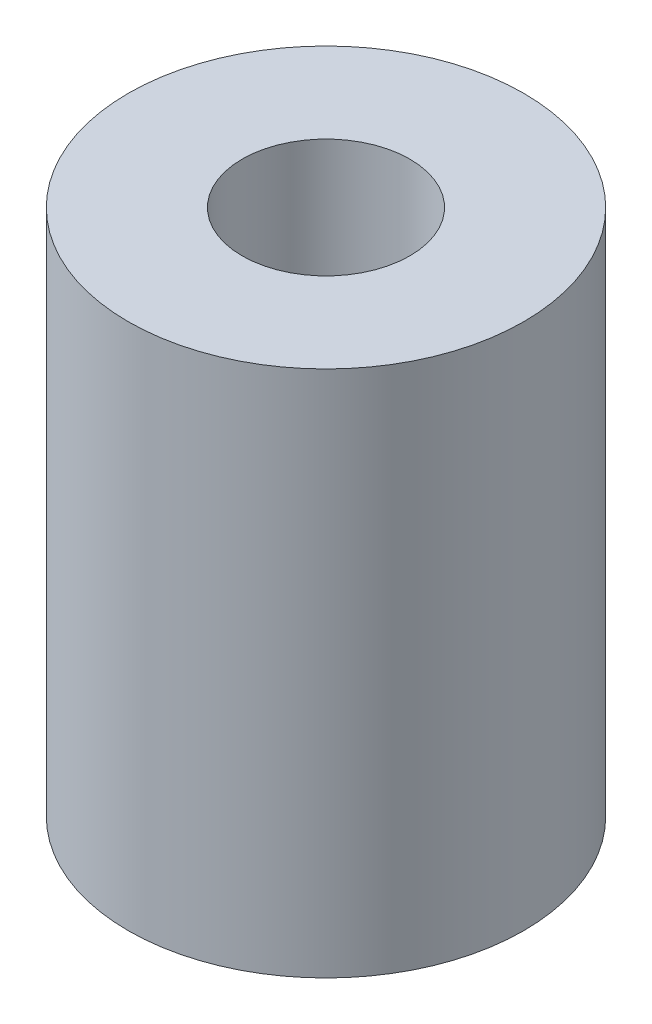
ISO-10303-21;
HEADER;
FILE_DESCRIPTION(('STEP AP214'),'2;1');
FILE_NAME('part.step','',(''),(''),'','','');
FILE_SCHEMA(('AUTOMOTIVE_DESIGN { 1 0 10303 214 1 1 1 1 }'));
ENDSEC;
DATA;
#1=APPLICATION_CONTEXT('core data for automotive mechanical design processes');
#2=APPLICATION_PROTOCOL_DEFINITION('international standard','automotive_design',2000,#1);
#3=PRODUCT_CONTEXT('',#1,'mechanical');
#4=PRODUCT('Part','Part','',(#3));
#5=PRODUCT_RELATED_PRODUCT_CATEGORY('part','',(#4));
#6=PRODUCT_DEFINITION_FORMATION('','',#4);
#7=PRODUCT_DEFINITION_CONTEXT('part definition',#1,'design');
#8=PRODUCT_DEFINITION('design','',#6,#7);
#9=PRODUCT_DEFINITION_SHAPE('','',#8);
#10=(LENGTH_UNIT() NAMED_UNIT(*) SI_UNIT(.MILLI.,.METRE.));
#11=(NAMED_UNIT(*) PLANE_ANGLE_UNIT() SI_UNIT($,.RADIAN.));
#12=(NAMED_UNIT(*) SI_UNIT($,.STERADIAN.) SOLID_ANGLE_UNIT());
#13=UNCERTAINTY_MEASURE_WITH_UNIT(LENGTH_MEASURE(1.E-05),#10,'distance_accuracy_value','');
#14=(GEOMETRIC_REPRESENTATION_CONTEXT(3) GLOBAL_UNCERTAINTY_ASSIGNED_CONTEXT((#13)) GLOBAL_UNIT_ASSIGNED_CONTEXT((#10,
#11,#12)) REPRESENTATION_CONTEXT('',''));
#15=CARTESIAN_POINT('',(0.,0.,0.));
#16=DIRECTION('',(0.,0.,1.));
#17=DIRECTION('',(1.,0.,0.));
#18=AXIS2_PLACEMENT_3D('',#15,#16,#17);
#19=CARTESIAN_POINT('',(0.,12.7,0.));
#20=DIRECTION('',(0.,-1.,0.));
#21=DIRECTION('',(0.,0.,-1.));
#22=AXIS2_PLACEMENT_3D('',#19,#20,#21);
#23=CYLINDRICAL_SURFACE('',#22,4.7625);
#24=CARTESIAN_POINT('',(0.,12.7,0.));
#25=DIRECTION('',(0.,1.,0.));
#26=DIRECTION('',(0.,0.,1.));
#27=AXIS2_PLACEMENT_3D('',#24,#25,#26);
#28=CIRCLE('',#27,4.7625);
#29=CARTESIAN_POINT('',(0.,12.7,4.7625));
#30=VERTEX_POINT('',#29);
#31=EDGE_CURVE('E10',#30,#30,#28,.T.);
#32=ORIENTED_EDGE('',*,*,#31,.F.);
#33=EDGE_LOOP('',(#32));
#34=FACE_BOUND('',#33,.T.);
#35=CARTESIAN_POINT('',(0.,0.,0.));
#36=DIRECTION('',(0.,1.,0.));
#37=DIRECTION('',(0.,0.,1.));
#38=AXIS2_PLACEMENT_3D('',#35,#36,#37);
#39=CIRCLE('',#38,4.7625);
#40=CARTESIAN_POINT('',(0.,0.,4.7625));
#41=VERTEX_POINT('',#40);
#42=EDGE_CURVE('E38',#41,#41,#39,.T.);
#43=ORIENTED_EDGE('',*,*,#42,.T.);
#44=EDGE_LOOP('',(#43));
#45=FACE_BOUND('',#44,.T.);
#46=ADVANCED_FACE('F35',(#34,#45),#23,.T.);
#47=CARTESIAN_POINT('',(0.,12.7,0.));
#48=DIRECTION('',(0.,1.,0.));
#49=DIRECTION('',(0.,0.,1.));
#50=AXIS2_PLACEMENT_3D('',#47,#48,#49);
#51=PLANE('',#50);
#52=CARTESIAN_POINT('',(0.,12.7,0.));
#53=DIRECTION('',(0.,1.,0.));
#54=DIRECTION('',(0.,0.,1.));
#55=AXIS2_PLACEMENT_3D('',#52,#53,#54);
#56=CIRCLE('',#55,2.0193);
#57=CARTESIAN_POINT('',(0.,12.7,2.0193));
#58=VERTEX_POINT('',#57);
#59=EDGE_CURVE('E47',#58,#58,#56,.T.);
#60=ORIENTED_EDGE('',*,*,#59,.F.);
#61=EDGE_LOOP('',(#60));
#62=FACE_BOUND('',#61,.T.);
#63=ORIENTED_EDGE('',*,*,#31,.T.);
#64=EDGE_LOOP('',(#63));
#65=FACE_BOUND('',#64,.T.);
#66=ADVANCED_FACE('F62',(#62,#65),#51,.T.);
#67=CARTESIAN_POINT('',(0.,0.,0.));
#68=DIRECTION('',(0.,1.,0.));
#69=DIRECTION('',(0.,0.,1.));
#70=AXIS2_PLACEMENT_3D('',#67,#68,#69);
#71=PLANE('',#70);
#72=CARTESIAN_POINT('',(0.,0.,0.));
#73=DIRECTION('',(0.,1.,0.));
#74=DIRECTION('',(0.,0.,1.));
#75=AXIS2_PLACEMENT_3D('',#72,#73,#74);
#76=CIRCLE('',#75,2.0193);
#77=CARTESIAN_POINT('',(0.,0.,2.0193));
#78=VERTEX_POINT('',#77);
#79=EDGE_CURVE('E45',#78,#78,#76,.T.);
#80=ORIENTED_EDGE('',*,*,#79,.T.);
#81=EDGE_LOOP('',(#80));
#82=FACE_BOUND('',#81,.T.);
#83=ORIENTED_EDGE('',*,*,#42,.F.);
#84=EDGE_LOOP('',(#83));
#85=FACE_BOUND('',#84,.T.);
#86=ADVANCED_FACE('F53',(#82,#85),#71,.F.);
#87=CARTESIAN_POINT('',(0.,0.,0.));
#88=DIRECTION('',(0.,1.,0.));
#89=DIRECTION('',(0.,0.,1.));
#90=AXIS2_PLACEMENT_3D('',#87,#88,#89);
#91=CYLINDRICAL_SURFACE('',#90,2.0193);
#92=ORIENTED_EDGE('',*,*,#79,.F.);
#93=EDGE_LOOP('',(#92));
#94=FACE_BOUND('',#93,.T.);
#95=ORIENTED_EDGE('',*,*,#59,.T.);
#96=EDGE_LOOP('',(#95));
#97=FACE_BOUND('',#96,.T.);
#98=ADVANCED_FACE('F56',(#94,#97),#91,.F.);
#99=CLOSED_SHELL('',(#46,#66,#86,#98));
#100=MANIFOLD_SOLID_BREP('B2',#99);
#101=ADVANCED_BREP_SHAPE_REPRESENTATION('',(#18,#100),#14);
#102=SHAPE_DEFINITION_REPRESENTATION(#9,#101);
ENDSEC;
END-ISO-10303-21;
